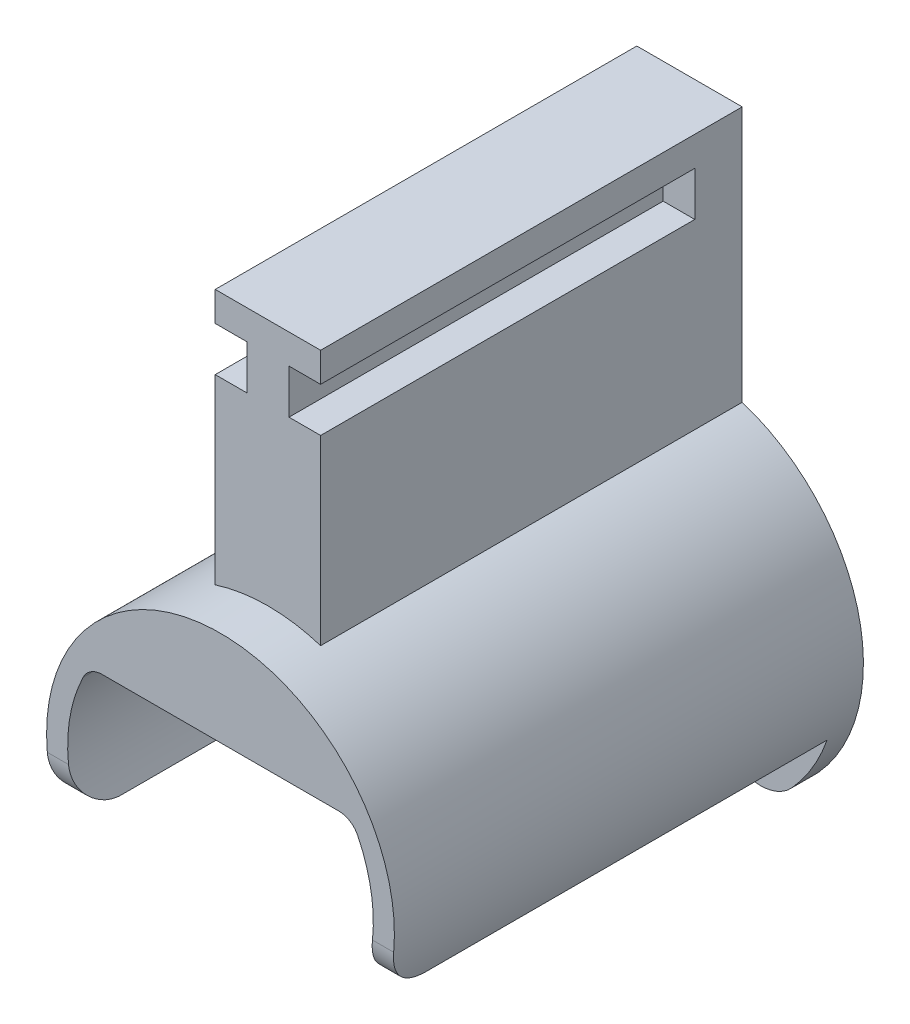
ISO-10303-21;
HEADER;
FILE_DESCRIPTION(('STEP AP214'),'2;1');
FILE_NAME('part.step','',(''),(''),'','','');
FILE_SCHEMA(('AUTOMOTIVE_DESIGN { 1 0 10303 214 1 1 1 1 }'));
ENDSEC;
DATA;
#1=APPLICATION_CONTEXT('core data for automotive mechanical design processes');
#2=APPLICATION_PROTOCOL_DEFINITION('international standard','automotive_design',2000,#1);
#3=PRODUCT_CONTEXT('',#1,'mechanical');
#4=PRODUCT('Part','Part','',(#3));
#5=PRODUCT_RELATED_PRODUCT_CATEGORY('part','',(#4));
#6=PRODUCT_DEFINITION_FORMATION('','',#4);
#7=PRODUCT_DEFINITION_CONTEXT('part definition',#1,'design');
#8=PRODUCT_DEFINITION('design','',#6,#7);
#9=PRODUCT_DEFINITION_SHAPE('','',#8);
#10=(LENGTH_UNIT() NAMED_UNIT(*) SI_UNIT(.MILLI.,.METRE.));
#11=(NAMED_UNIT(*) PLANE_ANGLE_UNIT() SI_UNIT($,.RADIAN.));
#12=(NAMED_UNIT(*) SI_UNIT($,.STERADIAN.) SOLID_ANGLE_UNIT());
#13=UNCERTAINTY_MEASURE_WITH_UNIT(LENGTH_MEASURE(1.E-05),#10,'distance_accuracy_value','');
#14=(GEOMETRIC_REPRESENTATION_CONTEXT(3) GLOBAL_UNCERTAINTY_ASSIGNED_CONTEXT((#13)) GLOBAL_UNIT_ASSIGNED_CONTEXT((#10,
#11,#12)) REPRESENTATION_CONTEXT('',''));
#15=CARTESIAN_POINT('',(0.,0.,0.));
#16=DIRECTION('',(0.,0.,1.));
#17=DIRECTION('',(1.,0.,0.));
#18=AXIS2_PLACEMENT_3D('',#15,#16,#17);
#19=CARTESIAN_POINT('',(5.,40.,70.7548125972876));
#20=DIRECTION('',(-1.,0.,0.));
#21=DIRECTION('',(0.,-1.,0.));
#22=AXIS2_PLACEMENT_3D('',#19,#20,#21);
#23=PLANE('',#22);
#24=DIRECTION('',(0.,1.,0.));
#25=VECTOR('',#24,1.);
#26=CARTESIAN_POINT('',(4.99999999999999,40.,40.));
#27=LINE('',#26,#25);
#28=CARTESIAN_POINT('',(5.,15.7241851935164,40.));
#29=VERTEX_POINT('',#28);
#30=CARTESIAN_POINT('',(5.,33.,40.));
#31=VERTEX_POINT('',#30);
#32=EDGE_CURVE('E616',#29,#31,#27,.T.);
#33=ORIENTED_EDGE('',*,*,#32,.F.);
#34=DIRECTION('',(0.,0.,-1.));
#35=VECTOR('',#34,1.);
#36=CARTESIAN_POINT('',(5.,15.7241851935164,70.7548125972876));
#37=LINE('',#36,#35);
#38=CARTESIAN_POINT('',(5.,15.7241851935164,0.));
#39=VERTEX_POINT('',#38);
#40=EDGE_CURVE('E245',#29,#39,#37,.T.);
#41=ORIENTED_EDGE('',*,*,#40,.T.);
#42=DIRECTION('',(0.,1.,0.));
#43=VECTOR('',#42,1.);
#44=CARTESIAN_POINT('',(5.,40.,0.));
#45=LINE('',#44,#43);
#46=CARTESIAN_POINT('',(5.,40.,0.));
#47=VERTEX_POINT('',#46);
#48=EDGE_CURVE('E254',#39,#47,#45,.T.);
#49=ORIENTED_EDGE('',*,*,#48,.T.);
#50=DIRECTION('',(0.,0.,-1.));
#51=VECTOR('',#50,1.);
#52=CARTESIAN_POINT('',(5.,40.,70.7548125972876));
#53=LINE('',#52,#51);
#54=CARTESIAN_POINT('',(4.99999999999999,40.,40.));
#55=VERTEX_POINT('',#54);
#56=EDGE_CURVE('E260',#55,#47,#53,.T.);
#57=ORIENTED_EDGE('',*,*,#56,.F.);
#58=CARTESIAN_POINT('',(4.99999999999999,37.2,40.));
#59=VERTEX_POINT('',#58);
#60=EDGE_CURVE('E246',#59,#55,#27,.T.);
#61=ORIENTED_EDGE('',*,*,#60,.F.);
#62=DIRECTION('',(0.,0.,-1.));
#63=VECTOR('',#62,1.);
#64=CARTESIAN_POINT('',(5.00000000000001,37.2,4.5));
#65=LINE('',#64,#63);
#66=CARTESIAN_POINT('',(5.,37.2,4.5));
#67=VERTEX_POINT('',#66);
#68=EDGE_CURVE('E591',#59,#67,#65,.T.);
#69=ORIENTED_EDGE('',*,*,#68,.T.);
#70=DIRECTION('',(0.,-1.,0.));
#71=VECTOR('',#70,1.);
#72=CARTESIAN_POINT('',(5.00000000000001,37.2,4.5));
#73=LINE('',#72,#71);
#74=CARTESIAN_POINT('',(5.00000000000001,33.,4.5));
#75=VERTEX_POINT('',#74);
#76=EDGE_CURVE('E593',#67,#75,#73,.T.);
#77=ORIENTED_EDGE('',*,*,#76,.T.);
#78=DIRECTION('',(0.,0.,1.));
#79=VECTOR('',#78,1.);
#80=CARTESIAN_POINT('',(5.00000000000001,33.,4.5));
#81=LINE('',#80,#79);
#82=EDGE_CURVE('E587',#75,#31,#81,.T.);
#83=ORIENTED_EDGE('',*,*,#82,.T.);
#84=EDGE_LOOP('',(#33,#41,#49,#57,#61,#69,#77,#83));
#85=FACE_BOUND('',#84,.T.);
#86=ADVANCED_FACE('F33',(#85),#23,.F.);
#87=CARTESIAN_POINT('',(-5.,40.,70.7548125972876));
#88=DIRECTION('',(1.,0.,0.));
#89=DIRECTION('',(0.,1.,0.));
#90=AXIS2_PLACEMENT_3D('',#87,#88,#89);
#91=PLANE('',#90);
#92=DIRECTION('',(0.,-1.,0.));
#93=VECTOR('',#92,1.);
#94=CARTESIAN_POINT('',(-5.,40.,40.));
#95=LINE('',#94,#93);
#96=CARTESIAN_POINT('',(-5.,40.,40.));
#97=VERTEX_POINT('',#96);
#98=CARTESIAN_POINT('',(-5.,37.2,40.));
#99=VERTEX_POINT('',#98);
#100=EDGE_CURVE('E236',#97,#99,#95,.T.);
#101=ORIENTED_EDGE('',*,*,#100,.F.);
#102=DIRECTION('',(0.,0.,-1.));
#103=VECTOR('',#102,1.);
#104=CARTESIAN_POINT('',(-5.,40.,70.7548125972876));
#105=LINE('',#104,#103);
#106=CARTESIAN_POINT('',(-5.,40.,0.));
#107=VERTEX_POINT('',#106);
#108=EDGE_CURVE('E256',#97,#107,#105,.T.);
#109=ORIENTED_EDGE('',*,*,#108,.T.);
#110=DIRECTION('',(0.,-1.,0.));
#111=VECTOR('',#110,1.);
#112=CARTESIAN_POINT('',(-5.,40.,0.));
#113=LINE('',#112,#111);
#114=CARTESIAN_POINT('',(-5.,15.7241851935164,0.));
#115=VERTEX_POINT('',#114);
#116=EDGE_CURVE('E251',#107,#115,#113,.T.);
#117=ORIENTED_EDGE('',*,*,#116,.T.);
#118=DIRECTION('',(0.,0.,-1.));
#119=VECTOR('',#118,1.);
#120=CARTESIAN_POINT('',(-5.,15.7241851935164,70.7548125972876));
#121=LINE('',#120,#119);
#122=CARTESIAN_POINT('',(-5.,15.7241851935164,40.));
#123=VERTEX_POINT('',#122);
#124=EDGE_CURVE('E242',#123,#115,#121,.T.);
#125=ORIENTED_EDGE('',*,*,#124,.F.);
#126=CARTESIAN_POINT('',(-5.,33.,40.));
#127=VERTEX_POINT('',#126);
#128=EDGE_CURVE('E225',#127,#123,#95,.T.);
#129=ORIENTED_EDGE('',*,*,#128,.F.);
#130=DIRECTION('',(0.,0.,1.));
#131=VECTOR('',#130,1.);
#132=CARTESIAN_POINT('',(-5.00000000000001,33.,4.5));
#133=LINE('',#132,#131);
#134=CARTESIAN_POINT('',(-5.,33.,4.5));
#135=VERTEX_POINT('',#134);
#136=EDGE_CURVE('E570',#135,#127,#133,.T.);
#137=ORIENTED_EDGE('',*,*,#136,.F.);
#138=DIRECTION('',(0.,-1.,0.));
#139=VECTOR('',#138,1.);
#140=CARTESIAN_POINT('',(-5.00000000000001,37.2,4.5));
#141=LINE('',#140,#139);
#142=CARTESIAN_POINT('',(-5.00000000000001,37.2,4.5));
#143=VERTEX_POINT('',#142);
#144=EDGE_CURVE('E572',#143,#135,#141,.T.);
#145=ORIENTED_EDGE('',*,*,#144,.F.);
#146=DIRECTION('',(0.,0.,-1.));
#147=VECTOR('',#146,1.);
#148=CARTESIAN_POINT('',(-5.00000000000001,37.2,4.5));
#149=LINE('',#148,#147);
#150=EDGE_CURVE('E567',#99,#143,#149,.T.);
#151=ORIENTED_EDGE('',*,*,#150,.F.);
#152=EDGE_LOOP('',(#101,#109,#117,#125,#129,#137,#145,#151));
#153=FACE_BOUND('',#152,.T.);
#154=ADVANCED_FACE('F249',(#153),#91,.F.);
#155=CARTESIAN_POINT('',(-5.,40.,70.7548125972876));
#156=DIRECTION('',(0.,-1.,0.));
#157=DIRECTION('',(0.,0.,-1.));
#158=AXIS2_PLACEMENT_3D('',#155,#156,#157);
#159=PLANE('',#158);
#160=DIRECTION('',(-1.,0.,0.));
#161=VECTOR('',#160,1.);
#162=CARTESIAN_POINT('',(-5.,40.,40.));
#163=LINE('',#162,#161);
#164=EDGE_CURVE('E614',#55,#97,#163,.T.);
#165=ORIENTED_EDGE('',*,*,#164,.F.);
#166=ORIENTED_EDGE('',*,*,#56,.T.);
#167=DIRECTION('',(-1.,0.,0.));
#168=VECTOR('',#167,1.);
#169=CARTESIAN_POINT('',(-5.,40.,0.));
#170=LINE('',#169,#168);
#171=EDGE_CURVE('E262',#47,#107,#170,.T.);
#172=ORIENTED_EDGE('',*,*,#171,.T.);
#173=ORIENTED_EDGE('',*,*,#108,.F.);
#174=EDGE_LOOP('',(#165,#166,#172,#173));
#175=FACE_BOUND('',#174,.T.);
#176=ADVANCED_FACE('F401',(#175),#159,.F.);
#177=CARTESIAN_POINT('',(-2.00000000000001,37.2,4.5));
#178=DIRECTION('',(0.,1.,0.));
#179=DIRECTION('',(-1.,0.,0.));
#180=AXIS2_PLACEMENT_3D('',#177,#178,#179);
#181=PLANE('',#180);
#182=DIRECTION('',(1.,0.,0.));
#183=VECTOR('',#182,1.);
#184=CARTESIAN_POINT('',(-2.00000000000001,37.2,40.));
#185=LINE('',#184,#183);
#186=CARTESIAN_POINT('',(-2.00000000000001,37.2,40.));
#187=VERTEX_POINT('',#186);
#188=EDGE_CURVE('E596',#99,#187,#185,.T.);
#189=ORIENTED_EDGE('',*,*,#188,.F.);
#190=ORIENTED_EDGE('',*,*,#150,.T.);
#191=DIRECTION('',(-1.,0.,0.));
#192=VECTOR('',#191,1.);
#193=CARTESIAN_POINT('',(-2.00000000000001,37.2,4.5));
#194=LINE('',#193,#192);
#195=CARTESIAN_POINT('',(-2.00000000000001,37.2,4.5));
#196=VERTEX_POINT('',#195);
#197=EDGE_CURVE('E264',#196,#143,#194,.T.);
#198=ORIENTED_EDGE('',*,*,#197,.F.);
#199=DIRECTION('',(0.,0.,-1.));
#200=VECTOR('',#199,1.);
#201=CARTESIAN_POINT('',(-2.00000000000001,37.2,4.5));
#202=LINE('',#201,#200);
#203=EDGE_CURVE('E564',#187,#196,#202,.T.);
#204=ORIENTED_EDGE('',*,*,#203,.F.);
#205=EDGE_LOOP('',(#189,#190,#198,#204));
#206=FACE_BOUND('',#205,.T.);
#207=ADVANCED_FACE('F656',(#206),#181,.F.);
#208=CARTESIAN_POINT('',(-2.00000000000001,33.,4.5));
#209=DIRECTION('',(0.,-1.,0.));
#210=DIRECTION('',(1.,0.,0.));
#211=AXIS2_PLACEMENT_3D('',#208,#209,#210);
#212=PLANE('',#211);
#213=DIRECTION('',(-1.,0.,0.));
#214=VECTOR('',#213,1.);
#215=CARTESIAN_POINT('',(-2.00000000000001,33.,40.));
#216=LINE('',#215,#214);
#217=CARTESIAN_POINT('',(-2.00000000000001,33.,40.));
#218=VERTEX_POINT('',#217);
#219=EDGE_CURVE('E231',#218,#127,#216,.T.);
#220=ORIENTED_EDGE('',*,*,#219,.F.);
#221=DIRECTION('',(0.,0.,1.));
#222=VECTOR('',#221,1.);
#223=CARTESIAN_POINT('',(-2.00000000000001,33.,4.5));
#224=LINE('',#223,#222);
#225=CARTESIAN_POINT('',(-2.00000000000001,33.,4.5));
#226=VERTEX_POINT('',#225);
#227=EDGE_CURVE('E576',#226,#218,#224,.T.);
#228=ORIENTED_EDGE('',*,*,#227,.F.);
#229=DIRECTION('',(-1.,0.,0.));
#230=VECTOR('',#229,1.);
#231=CARTESIAN_POINT('',(-2.00000000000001,33.,4.5));
#232=LINE('',#231,#230);
#233=EDGE_CURVE('E561',#226,#135,#232,.T.);
#234=ORIENTED_EDGE('',*,*,#233,.T.);
#235=ORIENTED_EDGE('',*,*,#136,.T.);
#236=EDGE_LOOP('',(#220,#228,#234,#235));
#237=FACE_BOUND('',#236,.T.);
#238=ADVANCED_FACE('F654',(#237),#212,.F.);
#239=CARTESIAN_POINT('',(-2.,0.,0.));
#240=DIRECTION('',(-1.,0.,0.));
#241=DIRECTION('',(0.,-1.,0.));
#242=AXIS2_PLACEMENT_3D('',#239,#240,#241);
#243=PLANE('',#242);
#244=ORIENTED_EDGE('',*,*,#227,.T.);
#245=DIRECTION('',(0.,1.,0.));
#246=VECTOR('',#245,1.);
#247=CARTESIAN_POINT('',(-2.,0.,40.));
#248=LINE('',#247,#246);
#249=EDGE_CURVE('E605',#218,#187,#248,.T.);
#250=ORIENTED_EDGE('',*,*,#249,.T.);
#251=ORIENTED_EDGE('',*,*,#203,.T.);
#252=DIRECTION('',(0.,-1.,0.));
#253=VECTOR('',#252,1.);
#254=CARTESIAN_POINT('',(-2.00000000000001,37.2,4.5));
#255=LINE('',#254,#253);
#256=EDGE_CURVE('E569',#196,#226,#255,.T.);
#257=ORIENTED_EDGE('',*,*,#256,.T.);
#258=EDGE_LOOP('',(#244,#250,#251,#257));
#259=FACE_BOUND('',#258,.T.);
#260=ADVANCED_FACE('F644',(#259),#243,.T.);
#261=CARTESIAN_POINT('',(2.00000000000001,33.,4.5));
#262=DIRECTION('',(0.,1.,0.));
#263=DIRECTION('',(-1.,0.,0.));
#264=AXIS2_PLACEMENT_3D('',#261,#262,#263);
#265=PLANE('',#264);
#266=DIRECTION('',(0.,0.,1.));
#267=VECTOR('',#266,1.);
#268=CARTESIAN_POINT('',(2.00000000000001,33.,4.5));
#269=LINE('',#268,#267);
#270=CARTESIAN_POINT('',(2.00000000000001,33.,4.5));
#271=VERTEX_POINT('',#270);
#272=CARTESIAN_POINT('',(2.00000000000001,33.,40.));
#273=VERTEX_POINT('',#272);
#274=EDGE_CURVE('E584',#271,#273,#269,.T.);
#275=ORIENTED_EDGE('',*,*,#274,.T.);
#276=DIRECTION('',(1.,0.,0.));
#277=VECTOR('',#276,1.);
#278=CARTESIAN_POINT('',(2.00000000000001,33.,40.));
#279=LINE('',#278,#277);
#280=EDGE_CURVE('E608',#273,#31,#279,.T.);
#281=ORIENTED_EDGE('',*,*,#280,.T.);
#282=ORIENTED_EDGE('',*,*,#82,.F.);
#283=DIRECTION('',(1.,0.,0.));
#284=VECTOR('',#283,1.);
#285=CARTESIAN_POINT('',(2.00000000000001,33.,4.5));
#286=LINE('',#285,#284);
#287=EDGE_CURVE('E574',#271,#75,#286,.T.);
#288=ORIENTED_EDGE('',*,*,#287,.F.);
#289=EDGE_LOOP('',(#275,#281,#282,#288));
#290=FACE_BOUND('',#289,.T.);
#291=ADVANCED_FACE('F641',(#290),#265,.T.);
#292=CARTESIAN_POINT('',(2.00000000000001,37.2,4.5));
#293=DIRECTION('',(0.,-1.,0.));
#294=DIRECTION('',(1.,0.,0.));
#295=AXIS2_PLACEMENT_3D('',#292,#293,#294);
#296=PLANE('',#295);
#297=ORIENTED_EDGE('',*,*,#68,.F.);
#298=DIRECTION('',(-1.,0.,0.));
#299=VECTOR('',#298,1.);
#300=CARTESIAN_POINT('',(2.00000000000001,37.2,40.));
#301=LINE('',#300,#299);
#302=CARTESIAN_POINT('',(2.00000000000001,37.2,40.));
#303=VERTEX_POINT('',#302);
#304=EDGE_CURVE('E611',#59,#303,#301,.T.);
#305=ORIENTED_EDGE('',*,*,#304,.T.);
#306=DIRECTION('',(0.,0.,-1.));
#307=VECTOR('',#306,1.);
#308=CARTESIAN_POINT('',(2.00000000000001,37.2,4.5));
#309=LINE('',#308,#307);
#310=CARTESIAN_POINT('',(2.00000000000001,37.2,4.5));
#311=VERTEX_POINT('',#310);
#312=EDGE_CURVE('E599',#303,#311,#309,.T.);
#313=ORIENTED_EDGE('',*,*,#312,.T.);
#314=DIRECTION('',(1.,0.,0.));
#315=VECTOR('',#314,1.);
#316=CARTESIAN_POINT('',(2.00000000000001,37.2,4.5));
#317=LINE('',#316,#315);
#318=EDGE_CURVE('E581',#311,#67,#317,.T.);
#319=ORIENTED_EDGE('',*,*,#318,.T.);
#320=EDGE_LOOP('',(#297,#305,#313,#319));
#321=FACE_BOUND('',#320,.T.);
#322=ADVANCED_FACE('F639',(#321),#296,.T.);
#323=CARTESIAN_POINT('',(2.,0.,0.));
#324=DIRECTION('',(1.,0.,0.));
#325=DIRECTION('',(0.,-1.,0.));
#326=AXIS2_PLACEMENT_3D('',#323,#324,#325);
#327=PLANE('',#326);
#328=ORIENTED_EDGE('',*,*,#312,.F.);
#329=DIRECTION('',(0.,-1.,0.));
#330=VECTOR('',#329,1.);
#331=CARTESIAN_POINT('',(2.,0.,40.));
#332=LINE('',#331,#330);
#333=EDGE_CURVE('E433',#303,#273,#332,.T.);
#334=ORIENTED_EDGE('',*,*,#333,.T.);
#335=ORIENTED_EDGE('',*,*,#274,.F.);
#336=DIRECTION('',(0.,-1.,0.));
#337=VECTOR('',#336,1.);
#338=CARTESIAN_POINT('',(2.00000000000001,37.2,4.5));
#339=LINE('',#338,#337);
#340=EDGE_CURVE('E590',#311,#271,#339,.T.);
#341=ORIENTED_EDGE('',*,*,#340,.F.);
#342=EDGE_LOOP('',(#328,#334,#335,#341));
#343=FACE_BOUND('',#342,.T.);
#344=ADVANCED_FACE('F383',(#343),#327,.T.);
#345=CARTESIAN_POINT('',(0.,0.,44.5));
#346=DIRECTION('',(0.,0.,1.));
#347=DIRECTION('',(1.,0.,0.));
#348=AXIS2_PLACEMENT_3D('',#345,#346,#347);
#349=PLANE('',#348);
#350=CARTESIAN_POINT('',(0.,0.,44.5));
#351=DIRECTION('',(0.,0.,1.));
#352=DIRECTION('',(1.,0.,0.));
#353=AXIS2_PLACEMENT_3D('',#350,#351,#352);
#354=CIRCLE('',#353,16.5);
#355=CARTESIAN_POINT('',(16.431676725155,-1.5,44.5));
#356=VERTEX_POINT('',#355);
#357=CARTESIAN_POINT('',(-16.431676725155,-1.5,44.5));
#358=VERTEX_POINT('',#357);
#359=EDGE_CURVE('E302',#356,#358,#354,.T.);
#360=ORIENTED_EDGE('',*,*,#359,.T.);
#361=DIRECTION('',(-1.,0.,0.));
#362=VECTOR('',#361,1.);
#363=CARTESIAN_POINT('',(-13.4164078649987,-1.5,44.5));
#364=LINE('',#363,#362);
#365=CARTESIAN_POINT('',(-14.422205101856,-1.5,44.5));
#366=VERTEX_POINT('',#365);
#367=EDGE_CURVE('E552',#358,#366,#364,.F.);
#368=ORIENTED_EDGE('',*,*,#367,.T.);
#369=CARTESIAN_POINT('',(0.,0.,44.5));
#370=DIRECTION('',(0.,0.,1.));
#371=DIRECTION('',(1.,0.,0.));
#372=AXIS2_PLACEMENT_3D('',#369,#370,#371);
#373=CIRCLE('',#372,14.5);
#374=CARTESIAN_POINT('',(-13.0209677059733,6.38,44.5));
#375=VERTEX_POINT('',#374);
#376=EDGE_CURVE('E300',#375,#366,#373,.T.);
#377=ORIENTED_EDGE('',*,*,#376,.F.);
#378=CARTESIAN_POINT('',(-11.2249721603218,5.5,44.5));
#379=DIRECTION('',(0.,0.,1.));
#380=DIRECTION('',(1.,0.,0.));
#381=AXIS2_PLACEMENT_3D('',#378,#379,#380);
#382=CIRCLE('',#381,2.);
#383=CARTESIAN_POINT('',(-11.2249721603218,7.5,44.5));
#384=VERTEX_POINT('',#383);
#385=EDGE_CURVE('E508',#375,#384,#382,.F.);
#386=ORIENTED_EDGE('',*,*,#385,.T.);
#387=DIRECTION('',(1.,0.,0.));
#388=VECTOR('',#387,1.);
#389=CARTESIAN_POINT('',(-14.6969384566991,7.5,44.5));
#390=LINE('',#389,#388);
#391=CARTESIAN_POINT('',(11.2249721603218,7.5,44.5));
#392=VERTEX_POINT('',#391);
#393=EDGE_CURVE('E293',#384,#392,#390,.T.);
#394=ORIENTED_EDGE('',*,*,#393,.T.);
#395=CARTESIAN_POINT('',(11.2249721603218,5.5,44.5));
#396=DIRECTION('',(0.,0.,1.));
#397=DIRECTION('',(1.,0.,0.));
#398=AXIS2_PLACEMENT_3D('',#395,#396,#397);
#399=CIRCLE('',#398,2.);
#400=CARTESIAN_POINT('',(13.0209677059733,6.38,44.5));
#401=VERTEX_POINT('',#400);
#402=EDGE_CURVE('E506',#392,#401,#399,.F.);
#403=ORIENTED_EDGE('',*,*,#402,.T.);
#404=CARTESIAN_POINT('',(14.422205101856,-1.5,44.5));
#405=VERTEX_POINT('',#404);
#406=EDGE_CURVE('E297',#405,#401,#373,.T.);
#407=ORIENTED_EDGE('',*,*,#406,.F.);
#408=DIRECTION('',(-1.,0.,0.));
#409=VECTOR('',#408,1.);
#410=CARTESIAN_POINT('',(15.556349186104,-1.5,44.5));
#411=LINE('',#410,#409);
#412=EDGE_CURVE('E553',#405,#356,#411,.F.);
#413=ORIENTED_EDGE('',*,*,#412,.T.);
#414=EDGE_LOOP('',(#360,#368,#377,#386,#394,#403,#407,#413));
#415=FACE_BOUND('',#414,.T.);
#416=ADVANCED_FACE('F346',(#415),#349,.T.);
#417=CARTESIAN_POINT('',(0.,0.,2.5));
#418=DIRECTION('',(0.,0.,-1.));
#419=DIRECTION('',(-1.,0.,0.));
#420=AXIS2_PLACEMENT_3D('',#417,#418,#419);
#421=CYLINDRICAL_SURFACE('',#420,16.5);
#422=ORIENTED_EDGE('',*,*,#40,.F.);
#423=CARTESIAN_POINT('',(0.,0.,40.));
#424=DIRECTION('',(0.,0.,-1.));
#425=DIRECTION('',(1.,0.,0.));
#426=AXIS2_PLACEMENT_3D('',#423,#424,#425);
#427=CIRCLE('',#426,16.5);
#428=EDGE_CURVE('E228',#123,#29,#427,.T.);
#429=ORIENTED_EDGE('',*,*,#428,.F.);
#430=ORIENTED_EDGE('',*,*,#124,.T.);
#431=CARTESIAN_POINT('',(0.,0.,0.));
#432=DIRECTION('',(0.,0.,1.));
#433=DIRECTION('',(1.,0.,0.));
#434=AXIS2_PLACEMENT_3D('',#431,#432,#433);
#435=CIRCLE('',#434,16.5);
#436=CARTESIAN_POINT('',(-12.21,-11.0980133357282,0.));
#437=VERTEX_POINT('',#436);
#438=EDGE_CURVE('E308',#115,#437,#435,.T.);
#439=ORIENTED_EDGE('',*,*,#438,.T.);
#440=DIRECTION('',(0.,0.,-1.));
#441=VECTOR('',#440,1.);
#442=CARTESIAN_POINT('',(-12.21,-11.0980133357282,2.5));
#443=LINE('',#442,#441);
#444=CARTESIAN_POINT('',(-12.21,-11.0980133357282,2.5));
#445=VERTEX_POINT('',#444);
#446=EDGE_CURVE('E323',#437,#445,#443,.F.);
#447=ORIENTED_EDGE('',*,*,#446,.T.);
#448=CARTESIAN_POINT('',(0.,0.,2.5));
#449=DIRECTION('',(0.,0.,1.));
#450=DIRECTION('',(1.,0.,0.));
#451=AXIS2_PLACEMENT_3D('',#448,#449,#450);
#452=CIRCLE('',#451,16.5);
#453=CARTESIAN_POINT('',(-15.556349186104,-5.5,2.5));
#454=VERTEX_POINT('',#453);
#455=EDGE_CURVE('E285',#445,#454,#452,.F.);
#456=ORIENTED_EDGE('',*,*,#455,.T.);
#457=DIRECTION('',(0.,0.,1.));
#458=VECTOR('',#457,1.);
#459=CARTESIAN_POINT('',(-15.556349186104,-5.5,-30.5));
#460=LINE('',#459,#458);
#461=CARTESIAN_POINT('',(-15.556349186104,-5.5,40.5));
#462=VERTEX_POINT('',#461);
#463=EDGE_CURVE('E286',#454,#462,#460,.T.);
#464=ORIENTED_EDGE('',*,*,#463,.T.);
#465=CARTESIAN_POINT('',(-15.556349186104,-5.5,40.5));
#466=CARTESIAN_POINT('',(-15.5563352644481,-5.5000142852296,40.6088143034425));
#467=CARTESIAN_POINT('',(-15.5579187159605,-5.49556008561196,40.7176196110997));
#468=CARTESIAN_POINT('',(-15.5641764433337,-5.4778255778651,40.9343934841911));
#469=CARTESIAN_POINT('',(-15.5688499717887,-5.46454740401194,41.0423622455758));
#470=CARTESIAN_POINT('',(-15.5811663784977,-5.42932617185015,41.256391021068));
#471=CARTESIAN_POINT('',(-15.5888007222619,-5.4074080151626,41.3624556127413));
#472=CARTESIAN_POINT('',(-15.6068353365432,-5.35513308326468,41.5722163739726));
#473=CARTESIAN_POINT('',(-15.6172356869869,-5.32477606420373,41.6759124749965));
#474=CARTESIAN_POINT('',(-15.6522157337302,-5.22144569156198,41.9822862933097));
#475=CARTESIAN_POINT('',(-15.6805920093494,-5.13616497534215,42.180537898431));
#476=CARTESIAN_POINT('',(-15.7448718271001,-4.93558872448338,42.5598230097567));
#477=CARTESIAN_POINT('',(-15.7807794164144,-4.82027704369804,42.7408471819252));
#478=CARTESIAN_POINT('',(-15.8584007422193,-4.55854463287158,43.0872665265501));
#479=CARTESIAN_POINT('',(-15.9002674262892,-4.41121981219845,43.2519452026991));
#480=CARTESIAN_POINT('',(-15.9854633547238,-4.09173100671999,43.5547347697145));
#481=CARTESIAN_POINT('',(-16.0287930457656,-3.91955938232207,43.6928374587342));
#482=CARTESIAN_POINT('',(-16.1152971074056,-3.54753622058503,43.9438128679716));
#483=CARTESIAN_POINT('',(-16.158401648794,-3.34687576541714,44.0555133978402));
#484=CARTESIAN_POINT('',(-16.2394089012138,-2.92862196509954,44.243192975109));
#485=CARTESIAN_POINT('',(-16.2773156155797,-2.71104185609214,44.3191996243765));
#486=CARTESIAN_POINT('',(-16.3358551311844,-2.32730967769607,44.4170283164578));
#487=CARTESIAN_POINT('',(-16.3583566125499,-2.16374665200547,44.4480515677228));
#488=CARTESIAN_POINT('',(-16.3885750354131,-1.91612529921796,44.4791664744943));
#489=CARTESIAN_POINT('',(-16.3980591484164,-1.83320241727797,44.4869681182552));
#490=CARTESIAN_POINT('',(-16.4158012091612,-1.66687878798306,44.4973865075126));
#491=CARTESIAN_POINT('',(-16.4240588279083,-1.58347791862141,44.5000018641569));
#492=CARTESIAN_POINT('',(-16.431676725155,-1.5,44.5));
#493=B_SPLINE_CURVE_WITH_KNOTS('',3,(#465,#466,#467,#468,#469,#470,#471,#472,#473,#474,#475,
#476,#477,#478,#479,#480,#481,#482,#483,#484,#485,#486,#487,#488,#489,#490,#491,#492),
.UNSPECIFIED.,.F.,.F.,(4,2,2,2,2,2,2,2,2,2,2,2,2,4),(0.,0.326324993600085,0.652571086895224,
0.977883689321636,1.30320569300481,1.95298212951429,2.60310864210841,3.27477422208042,
3.94664675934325,4.64431393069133,5.34144070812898,5.84406101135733,6.09538887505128,
6.34678403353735),.UNSPECIFIED.);
#494=EDGE_CURVE('E333',#462,#358,#493,.T.);
#495=ORIENTED_EDGE('',*,*,#494,.T.);
#496=ORIENTED_EDGE('',*,*,#359,.F.);
#497=CARTESIAN_POINT('',(16.431676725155,-1.5,44.5));
#498=CARTESIAN_POINT('',(16.4214065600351,-1.61262660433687,44.5000122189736));
#499=CARTESIAN_POINT('',(16.4099576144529,-1.72513356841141,44.4952435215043));
#500=CARTESIAN_POINT('',(16.3848614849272,-1.94907931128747,44.4762956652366));
#501=CARTESIAN_POINT('',(16.3712148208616,-2.06051833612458,44.4621187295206));
#502=CARTESIAN_POINT('',(16.341909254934,-2.28131459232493,44.4245462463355));
#503=CARTESIAN_POINT('',(16.3262547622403,-2.39067579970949,44.4011706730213));
#504=CARTESIAN_POINT('',(16.2931475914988,-2.606782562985,44.3454518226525));
#505=CARTESIAN_POINT('',(16.2756948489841,-2.71352802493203,44.3131082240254));
#506=CARTESIAN_POINT('',(16.2210478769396,-3.02867181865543,44.2030473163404));
#507=CARTESIAN_POINT('',(16.1815255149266,-3.23226820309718,44.1122497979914));
#508=CARTESIAN_POINT('',(16.098996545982,-3.62104454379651,43.8985975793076));
#509=CARTESIAN_POINT('',(16.0559884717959,-3.80621667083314,43.775729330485));
#510=CARTESIAN_POINT('',(15.9685433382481,-4.15803987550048,43.4977216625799));
#511=CARTESIAN_POINT('',(15.9240974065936,-4.32411326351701,43.3418532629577));
#512=CARTESIAN_POINT('',(15.8384810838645,-4.62790370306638,43.0035647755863));
#513=CARTESIAN_POINT('',(15.7973112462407,-4.7656159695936,42.8211402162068));
#514=CARTESIAN_POINT('',(15.7407801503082,-4.94792024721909,42.5310127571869));
#515=CARTESIAN_POINT('',(15.7227726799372,-5.00474403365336,42.4313135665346));
#516=CARTESIAN_POINT('',(15.6889642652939,-5.1097397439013,42.2271178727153));
#517=CARTESIAN_POINT('',(15.6731624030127,-5.15791526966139,42.1226233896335));
#518=CARTESIAN_POINT('',(15.6441849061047,-5.24514954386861,41.9096416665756));
#519=CARTESIAN_POINT('',(15.6310072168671,-5.28421542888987,41.8011576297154));
#520=CARTESIAN_POINT('',(15.6076210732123,-5.35289426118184,41.5809749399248));
#521=CARTESIAN_POINT('',(15.5974116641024,-5.38251024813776,41.4692773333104));
#522=CARTESIAN_POINT('',(15.5781656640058,-5.43799933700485,41.216072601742));
#523=CARTESIAN_POINT('',(15.5700127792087,-5.46122637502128,41.0739008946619));
#524=CARTESIAN_POINT('',(15.5618307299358,-5.48447637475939,40.8593517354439));
#525=CARTESIAN_POINT('',(15.5597779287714,-5.49029461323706,40.7876256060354));
#526=CARTESIAN_POINT('',(15.5570365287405,-5.49805640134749,40.6439390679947));
#527=CARTESIAN_POINT('',(15.5563479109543,-5.5000000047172,40.5719786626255));
#528=CARTESIAN_POINT('',(15.556349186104,-5.5,40.5));
#529=B_SPLINE_CURVE_WITH_KNOTS('',3,(#497,#498,#499,#500,#501,#502,#503,#504,#505,#506,#507,
#508,#509,#510,#511,#512,#513,#514,#515,#516,#517,#518,#519,#520,#521,#522,#523,#524,#525,#526,
#527,#528),.UNSPECIFIED.,.F.,.F.,(4,2,2,2,2,2,2,2,2,2,2,2,2,2,2,4),(0.,0.339155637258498,
0.678231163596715,1.01657443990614,1.35492984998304,2.0307591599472,2.70687444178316,
3.39986657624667,4.09297553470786,4.44109076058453,4.7890606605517,5.13675703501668,
5.48434145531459,5.91615382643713,6.13202706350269,6.34789730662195),.UNSPECIFIED.);
#530=CARTESIAN_POINT('',(15.556349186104,-5.5,40.5));
#531=VERTEX_POINT('',#530);
#532=EDGE_CURVE('E326',#356,#531,#529,.T.);
#533=ORIENTED_EDGE('',*,*,#532,.T.);
#534=DIRECTION('',(0.,0.,1.));
#535=VECTOR('',#534,1.);
#536=CARTESIAN_POINT('',(15.556349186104,-5.5,-30.5));
#537=LINE('',#536,#535);
#538=CARTESIAN_POINT('',(15.556349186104,-5.5,2.5));
#539=VERTEX_POINT('',#538);
#540=EDGE_CURVE('E280',#539,#531,#537,.T.);
#541=ORIENTED_EDGE('',*,*,#540,.F.);
#542=CARTESIAN_POINT('',(12.21,-11.0980133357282,2.5));
#543=VERTEX_POINT('',#542);
#544=EDGE_CURVE('E281',#539,#543,#452,.F.);
#545=ORIENTED_EDGE('',*,*,#544,.T.);
#546=DIRECTION('',(0.,0.,-1.));
#547=VECTOR('',#546,1.);
#548=CARTESIAN_POINT('',(12.21,-11.0980133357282,2.5));
#549=LINE('',#548,#547);
#550=CARTESIAN_POINT('',(12.21,-11.0980133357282,0.));
#551=VERTEX_POINT('',#550);
#552=EDGE_CURVE('E321',#543,#551,#549,.T.);
#553=ORIENTED_EDGE('',*,*,#552,.T.);
#554=EDGE_CURVE('E311',#551,#39,#435,.T.);
#555=ORIENTED_EDGE('',*,*,#554,.T.);
#556=EDGE_LOOP('',(#422,#429,#430,#439,#447,#456,#464,#495,#496,#533,#541,#545,#553,#555));
#557=FACE_BOUND('',#556,.T.);
#558=ADVANCED_FACE('F241',(#557),#421,.T.);
#559=CARTESIAN_POINT('',(0.,0.,2.5));
#560=DIRECTION('',(0.,0.,1.));
#561=DIRECTION('',(1.,0.,0.));
#562=AXIS2_PLACEMENT_3D('',#559,#560,#561);
#563=PLANE('',#562);
#564=CARTESIAN_POINT('',(-8.,0.,2.5));
#565=DIRECTION('',(0.,0.,1.));
#566=DIRECTION('',(1.,0.,0.));
#567=AXIS2_PLACEMENT_3D('',#564,#565,#566);
#568=CIRCLE('',#567,1.5);
#569=CARTESIAN_POINT('',(-6.5,0.,2.5));
#570=VERTEX_POINT('',#569);
#571=EDGE_CURVE('E620',#570,#570,#568,.F.);
#572=ORIENTED_EDGE('',*,*,#571,.T.);
#573=EDGE_LOOP('',(#572));
#574=FACE_BOUND('',#573,.T.);
#575=CARTESIAN_POINT('',(8.,0.,2.5));
#576=DIRECTION('',(0.,0.,1.));
#577=DIRECTION('',(1.,0.,0.));
#578=AXIS2_PLACEMENT_3D('',#575,#576,#577);
#579=CIRCLE('',#578,1.5);
#580=CARTESIAN_POINT('',(9.5,0.,2.5));
#581=VERTEX_POINT('',#580);
#582=EDGE_CURVE('E237',#581,#581,#579,.F.);
#583=ORIENTED_EDGE('',*,*,#582,.T.);
#584=EDGE_LOOP('',(#583));
#585=FACE_BOUND('',#584,.T.);
#586=DIRECTION('',(1.,0.,0.));
#587=VECTOR('',#586,1.);
#588=CARTESIAN_POINT('',(-15.556349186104,-5.5,2.5));
#589=LINE('',#588,#587);
#590=CARTESIAN_POINT('',(12.328828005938,-5.5,2.5));
#591=VERTEX_POINT('',#590);
#592=EDGE_CURVE('E284',#591,#539,#589,.T.);
#593=ORIENTED_EDGE('',*,*,#592,.F.);
#594=CARTESIAN_POINT('',(0.,0.,2.5));
#595=DIRECTION('',(0.,0.,1.));
#596=DIRECTION('',(1.,0.,0.));
#597=AXIS2_PLACEMENT_3D('',#594,#595,#596);
#598=CIRCLE('',#597,13.5);
#599=CARTESIAN_POINT('',(-12.328828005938,-5.5,2.5));
#600=VERTEX_POINT('',#599);
#601=EDGE_CURVE('E512',#591,#600,#598,.T.);
#602=ORIENTED_EDGE('',*,*,#601,.T.);
#603=EDGE_CURVE('E291',#454,#600,#589,.T.);
#604=ORIENTED_EDGE('',*,*,#603,.F.);
#605=ORIENTED_EDGE('',*,*,#455,.F.);
#606=CARTESIAN_POINT('',(-9.25,-8.40758586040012,2.5));
#607=DIRECTION('',(0.,0.,1.));
#608=DIRECTION('',(1.,0.,0.));
#609=AXIS2_PLACEMENT_3D('',#606,#607,#608);
#610=CIRCLE('',#609,4.);
#611=CARTESIAN_POINT('',(-5.25,-8.40758586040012,2.5));
#612=VERTEX_POINT('',#611);
#613=EDGE_CURVE('E535',#445,#612,#610,.T.);
#614=ORIENTED_EDGE('',*,*,#613,.T.);
#615=DIRECTION('',(0.,-1.,0.));
#616=VECTOR('',#615,1.);
#617=CARTESIAN_POINT('',(-5.25,0.,2.5));
#618=LINE('',#617,#616);
#619=CARTESIAN_POINT('',(-5.25,0.,2.5));
#620=VERTEX_POINT('',#619);
#621=EDGE_CURVE('E268',#620,#612,#618,.T.);
#622=ORIENTED_EDGE('',*,*,#621,.F.);
#623=CARTESIAN_POINT('',(0.,0.,2.5));
#624=DIRECTION('',(0.,0.,1.));
#625=DIRECTION('',(1.,0.,0.));
#626=AXIS2_PLACEMENT_3D('',#623,#624,#625);
#627=CIRCLE('',#626,5.25);
#628=CARTESIAN_POINT('',(5.25,0.,2.5));
#629=VERTEX_POINT('',#628);
#630=EDGE_CURVE('E305',#629,#620,#627,.T.);
#631=ORIENTED_EDGE('',*,*,#630,.F.);
#632=DIRECTION('',(0.,1.,0.));
#633=VECTOR('',#632,1.);
#634=CARTESIAN_POINT('',(5.25,0.,2.5));
#635=LINE('',#634,#633);
#636=CARTESIAN_POINT('',(5.25,-8.40758586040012,2.5));
#637=VERTEX_POINT('',#636);
#638=EDGE_CURVE('E271',#637,#629,#635,.T.);
#639=ORIENTED_EDGE('',*,*,#638,.F.);
#640=CARTESIAN_POINT('',(9.25,-8.40758586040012,2.5));
#641=DIRECTION('',(0.,0.,1.));
#642=DIRECTION('',(1.,0.,0.));
#643=AXIS2_PLACEMENT_3D('',#640,#641,#642);
#644=CIRCLE('',#643,4.);
#645=EDGE_CURVE('E537',#637,#543,#644,.T.);
#646=ORIENTED_EDGE('',*,*,#645,.T.);
#647=ORIENTED_EDGE('',*,*,#544,.F.);
#648=EDGE_LOOP('',(#593,#602,#604,#605,#614,#622,#631,#639,#646,#647));
#649=FACE_BOUND('',#648,.T.);
#650=ADVANCED_FACE('F345',(#574,#585,#649),#563,.T.);
#651=CARTESIAN_POINT('',(0.,0.,0.));
#652=DIRECTION('',(0.,0.,1.));
#653=DIRECTION('',(1.,0.,0.));
#654=AXIS2_PLACEMENT_3D('',#651,#652,#653);
#655=PLANE('',#654);
#656=CARTESIAN_POINT('',(-8.,0.,0.));
#657=DIRECTION('',(0.,0.,1.));
#658=DIRECTION('',(1.,0.,0.));
#659=AXIS2_PLACEMENT_3D('',#656,#657,#658);
#660=CIRCLE('',#659,2.50000000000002);
#661=CARTESIAN_POINT('',(-5.49999999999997,0.,0.));
#662=VERTEX_POINT('',#661);
#663=EDGE_CURVE('E41',#662,#662,#660,.T.);
#664=ORIENTED_EDGE('',*,*,#663,.T.);
#665=EDGE_LOOP('',(#664));
#666=FACE_BOUND('',#665,.T.);
#667=CARTESIAN_POINT('',(8.,0.,0.));
#668=DIRECTION('',(0.,0.,1.));
#669=DIRECTION('',(1.,0.,0.));
#670=AXIS2_PLACEMENT_3D('',#667,#668,#669);
#671=CIRCLE('',#670,2.50000000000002);
#672=CARTESIAN_POINT('',(10.5,0.,0.));
#673=VERTEX_POINT('',#672);
#674=EDGE_CURVE('E756',#673,#673,#671,.T.);
#675=ORIENTED_EDGE('',*,*,#674,.T.);
#676=EDGE_LOOP('',(#675));
#677=FACE_BOUND('',#676,.T.);
#678=DIRECTION('',(0.,1.,0.));
#679=VECTOR('',#678,1.);
#680=CARTESIAN_POINT('',(-5.25,0.,0.));
#681=LINE('',#680,#679);
#682=CARTESIAN_POINT('',(-5.25,-8.40758586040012,0.));
#683=VERTEX_POINT('',#682);
#684=CARTESIAN_POINT('',(-5.25,0.,0.));
#685=VERTEX_POINT('',#684);
#686=EDGE_CURVE('E277',#683,#685,#681,.T.);
#687=ORIENTED_EDGE('',*,*,#686,.F.);
#688=CARTESIAN_POINT('',(-9.25,-8.40758586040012,0.));
#689=DIRECTION('',(0.,0.,1.));
#690=DIRECTION('',(1.,0.,0.));
#691=AXIS2_PLACEMENT_3D('',#688,#689,#690);
#692=CIRCLE('',#691,4.);
#693=EDGE_CURVE('E486',#683,#437,#692,.F.);
#694=ORIENTED_EDGE('',*,*,#693,.T.);
#695=ORIENTED_EDGE('',*,*,#438,.F.);
#696=ORIENTED_EDGE('',*,*,#116,.F.);
#697=ORIENTED_EDGE('',*,*,#171,.F.);
#698=ORIENTED_EDGE('',*,*,#48,.F.);
#699=ORIENTED_EDGE('',*,*,#554,.F.);
#700=CARTESIAN_POINT('',(9.25,-8.40758586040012,0.));
#701=DIRECTION('',(0.,0.,1.));
#702=DIRECTION('',(1.,0.,0.));
#703=AXIS2_PLACEMENT_3D('',#700,#701,#702);
#704=CIRCLE('',#703,4.);
#705=CARTESIAN_POINT('',(5.25,-8.40758586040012,0.));
#706=VERTEX_POINT('',#705);
#707=EDGE_CURVE('E491',#551,#706,#704,.F.);
#708=ORIENTED_EDGE('',*,*,#707,.T.);
#709=DIRECTION('',(0.,-1.,0.));
#710=VECTOR('',#709,1.);
#711=CARTESIAN_POINT('',(5.25,0.,0.));
#712=LINE('',#711,#710);
#713=CARTESIAN_POINT('',(5.25,0.,0.));
#714=VERTEX_POINT('',#713);
#715=EDGE_CURVE('E265',#714,#706,#712,.T.);
#716=ORIENTED_EDGE('',*,*,#715,.F.);
#717=CARTESIAN_POINT('',(0.,0.,0.));
#718=DIRECTION('',(0.,0.,1.));
#719=DIRECTION('',(1.,0.,0.));
#720=AXIS2_PLACEMENT_3D('',#717,#718,#719);
#721=CIRCLE('',#720,5.25);
#722=EDGE_CURVE('E304',#714,#685,#721,.T.);
#723=ORIENTED_EDGE('',*,*,#722,.T.);
#724=EDGE_LOOP('',(#687,#694,#695,#696,#697,#698,#699,#708,#716,#723));
#725=FACE_BOUND('',#724,.T.);
#726=ADVANCED_FACE('F347',(#666,#677,#725),#655,.F.);
#727=CARTESIAN_POINT('',(0.,0.,2.5));
#728=DIRECTION('',(0.,0.,-1.));
#729=DIRECTION('',(-1.,0.,0.));
#730=AXIS2_PLACEMENT_3D('',#727,#728,#729);
#731=CYLINDRICAL_SURFACE('',#730,5.25);
#732=DIRECTION('',(0.,0.,1.));
#733=VECTOR('',#732,1.);
#734=CARTESIAN_POINT('',(5.25,0.,-0.00100000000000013));
#735=LINE('',#734,#733);
#736=EDGE_CURVE('E274',#714,#629,#735,.T.);
#737=ORIENTED_EDGE('',*,*,#736,.T.);
#738=ORIENTED_EDGE('',*,*,#630,.T.);
#739=DIRECTION('',(0.,0.,1.));
#740=VECTOR('',#739,1.);
#741=CARTESIAN_POINT('',(-5.25,0.,-0.00100000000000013));
#742=LINE('',#741,#740);
#743=EDGE_CURVE('E273',#685,#620,#742,.T.);
#744=ORIENTED_EDGE('',*,*,#743,.F.);
#745=ORIENTED_EDGE('',*,*,#722,.F.);
#746=EDGE_LOOP('',(#737,#738,#744,#745));
#747=FACE_BOUND('',#746,.T.);
#748=ADVANCED_FACE('F378',(#747),#731,.F.);
#749=CARTESIAN_POINT('',(0.,0.,44.5));
#750=DIRECTION('',(0.,0.,-1.));
#751=DIRECTION('',(-1.,0.,0.));
#752=AXIS2_PLACEMENT_3D('',#749,#750,#751);
#753=CYLINDRICAL_SURFACE('',#752,14.5);
#754=CARTESIAN_POINT('',(0.,0.,41.));
#755=DIRECTION('',(0.,0.,1.));
#756=DIRECTION('',(1.,0.,0.));
#757=AXIS2_PLACEMENT_3D('',#754,#755,#756);
#758=CIRCLE('',#757,14.5);
#759=CARTESIAN_POINT('',(13.0209677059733,6.38,41.));
#760=VERTEX_POINT('',#759);
#761=CARTESIAN_POINT('',(-13.0209677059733,6.38,41.));
#762=VERTEX_POINT('',#761);
#763=EDGE_CURVE('E684',#760,#762,#758,.T.);
#764=ORIENTED_EDGE('',*,*,#763,.T.);
#765=DIRECTION('',(0.,0.,-1.));
#766=VECTOR('',#765,1.);
#767=CARTESIAN_POINT('',(-13.0209677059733,6.38,44.5));
#768=LINE('',#767,#766);
#769=EDGE_CURVE('E48',#762,#375,#768,.F.);
#770=ORIENTED_EDGE('',*,*,#769,.T.);
#771=ORIENTED_EDGE('',*,*,#376,.T.);
#772=CARTESIAN_POINT('',(-14.422205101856,-1.5,44.5));
#773=CARTESIAN_POINT('',(-14.4105030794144,-1.61263497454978,44.5000126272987));
#774=CARTESIAN_POINT('',(-14.3974581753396,-1.72511619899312,44.4952428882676));
#775=CARTESIAN_POINT('',(-14.3688652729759,-1.94893270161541,44.4763101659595));
#776=CARTESIAN_POINT('',(-14.3533180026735,-2.06026830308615,44.4621499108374));
#777=CARTESIAN_POINT('',(-14.3199389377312,-2.28073807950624,44.4246556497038));
#778=CARTESIAN_POINT('',(-14.3021131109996,-2.38987717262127,44.4013452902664));
#779=CARTESIAN_POINT('',(-14.2644133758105,-2.60547711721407,44.3458194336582));
#780=CARTESIAN_POINT('',(-14.2445393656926,-2.71193783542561,44.3136034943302));
#781=CARTESIAN_POINT('',(-14.1823161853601,-3.02609810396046,44.2040642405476));
#782=CARTESIAN_POINT('',(-14.1373123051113,-3.228922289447,44.1137896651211));
#783=CARTESIAN_POINT('',(-14.0432549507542,-3.61619489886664,43.9015559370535));
#784=CARTESIAN_POINT('',(-13.9941991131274,-3.80063245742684,43.779578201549));
#785=CARTESIAN_POINT('',(-13.8939182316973,-4.15253954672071,43.5026298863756));
#786=CARTESIAN_POINT('',(-13.8426745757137,-4.31926077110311,43.3467141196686));
#787=CARTESIAN_POINT('',(-13.7437625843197,-4.62436739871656,43.0080299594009));
#788=CARTESIAN_POINT('',(-13.6960949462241,-4.76274728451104,42.8252563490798));
#789=CARTESIAN_POINT('',(-13.630466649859,-4.94617434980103,42.5340118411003));
#790=CARTESIAN_POINT('',(-13.6095092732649,-5.00344352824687,42.4337185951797));
#791=CARTESIAN_POINT('',(-13.5701380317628,-5.10925998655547,42.2281728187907));
#792=CARTESIAN_POINT('',(-13.5517230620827,-5.15781105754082,42.1229224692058));
#793=CARTESIAN_POINT('',(-13.5179508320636,-5.24568620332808,41.9082865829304));
#794=CARTESIAN_POINT('',(-13.502590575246,-5.28501932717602,41.7989052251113));
#795=CARTESIAN_POINT('',(-13.4753487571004,-5.35409667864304,41.576785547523));
#796=CARTESIAN_POINT('',(-13.463465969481,-5.38384428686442,41.4640484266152));
#797=CARTESIAN_POINT('',(-13.4413331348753,-5.43890158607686,41.2108547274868));
#798=CARTESIAN_POINT('',(-13.4320222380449,-5.46178283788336,41.0697717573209));
#799=CARTESIAN_POINT('',(-13.4226739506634,-5.48469521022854,40.8568120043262));
#800=CARTESIAN_POINT('',(-13.4203275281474,-5.49043108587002,40.7855969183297));
#801=CARTESIAN_POINT('',(-13.4171936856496,-5.49808360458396,40.6429273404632));
#802=CARTESIAN_POINT('',(-13.4164062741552,-5.5000002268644,40.5714728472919));
#803=CARTESIAN_POINT('',(-13.4164078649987,-5.5,40.5));
#804=B_SPLINE_CURVE_WITH_KNOTS('',3,(#772,#773,#774,#775,#776,#777,#778,#779,#780,#781,#782,
#783,#784,#785,#786,#787,#788,#789,#790,#791,#792,#793,#794,#795,#796,#797,#798,#799,#800,#801,
#802,#803),.UNSPECIFIED.,.F.,.F.,(4,2,2,2,2,2,2,2,2,2,2,2,2,2,2,4),(0.,0.33959288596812,
0.679087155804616,1.01770978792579,1.35634923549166,2.03257429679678,2.70919662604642,
3.40785667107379,4.1066526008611,4.45841152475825,4.8100171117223,5.16127607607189,
5.51241102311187,5.94104204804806,6.15539306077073,6.36974524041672),.UNSPECIFIED.);
#805=CARTESIAN_POINT('',(-13.4164078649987,-5.5,40.5));
#806=VERTEX_POINT('',#805);
#807=EDGE_CURVE('E357',#366,#806,#804,.T.);
#808=ORIENTED_EDGE('',*,*,#807,.T.);
#809=DIRECTION('',(0.,0.,-1.));
#810=VECTOR('',#809,1.);
#811=CARTESIAN_POINT('',(-13.4164078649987,-5.5,44.5));
#812=LINE('',#811,#810);
#813=CARTESIAN_POINT('',(-13.4164078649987,-5.5,3.50000000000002));
#814=VERTEX_POINT('',#813);
#815=EDGE_CURVE('E313',#814,#806,#812,.F.);
#816=ORIENTED_EDGE('',*,*,#815,.F.);
#817=CARTESIAN_POINT('',(0.,0.,3.5));
#818=DIRECTION('',(0.,0.,1.));
#819=DIRECTION('',(1.,0.,0.));
#820=AXIS2_PLACEMENT_3D('',#817,#818,#819);
#821=CIRCLE('',#820,14.5);
#822=CARTESIAN_POINT('',(13.4164078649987,-5.5,3.50000000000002));
#823=VERTEX_POINT('',#822);
#824=EDGE_CURVE('E510',#814,#823,#821,.F.);
#825=ORIENTED_EDGE('',*,*,#824,.T.);
#826=DIRECTION('',(0.,0.,-1.));
#827=VECTOR('',#826,1.);
#828=CARTESIAN_POINT('',(13.4164078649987,-5.5,44.5));
#829=LINE('',#828,#827);
#830=CARTESIAN_POINT('',(13.4164078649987,-5.5,40.5));
#831=VERTEX_POINT('',#830);
#832=EDGE_CURVE('E315',#831,#823,#829,.T.);
#833=ORIENTED_EDGE('',*,*,#832,.F.);
#834=CARTESIAN_POINT('',(13.4164078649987,-5.5,40.5));
#835=CARTESIAN_POINT('',(13.4163913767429,-5.50001529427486,40.607699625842));
#836=CARTESIAN_POINT('',(13.4181906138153,-5.49565066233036,40.715388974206));
#837=CARTESIAN_POINT('',(13.4252971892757,-5.47828038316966,40.9299200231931));
#838=CARTESIAN_POINT('',(13.4306034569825,-5.46527737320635,41.0367619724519));
#839=CARTESIAN_POINT('',(13.4445765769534,-5.43080900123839,41.2484695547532));
#840=CARTESIAN_POINT('',(13.4532316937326,-5.40937318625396,41.3533407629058));
#841=CARTESIAN_POINT('',(13.4736646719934,-5.35827521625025,41.560722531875));
#842=CARTESIAN_POINT('',(13.4854426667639,-5.32861271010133,41.6632329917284));
#843=CARTESIAN_POINT('',(13.5250212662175,-5.22772180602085,41.966023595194));
#844=CARTESIAN_POINT('',(13.5570909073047,-5.14453247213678,42.1619113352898));
#845=CARTESIAN_POINT('',(13.6296570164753,-4.94906635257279,42.5368527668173));
#846=CARTESIAN_POINT('',(13.6701596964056,-4.83676811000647,42.7158939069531));
#847=CARTESIAN_POINT('',(13.7581116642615,-4.58076657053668,43.0606454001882));
#848=CARTESIAN_POINT('',(13.8057849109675,-4.43591959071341,43.2254502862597));
#849=CARTESIAN_POINT('',(13.9028629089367,-4.12158214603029,43.5290413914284));
#850=CARTESIAN_POINT('',(13.9522682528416,-3.95208318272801,43.6678185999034));
#851=CARTESIAN_POINT('',(14.0516611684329,-3.58316878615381,43.9224478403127));
#852=CARTESIAN_POINT('',(14.1015503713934,-3.38266973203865,44.0367733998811));
#853=CARTESIAN_POINT('',(14.1954492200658,-2.96396830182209,44.2295884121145));
#854=CARTESIAN_POINT('',(14.2394637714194,-2.74578094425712,44.3081078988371));
#855=CARTESIAN_POINT('',(14.3083050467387,-2.35601685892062,44.4110929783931));
#856=CARTESIAN_POINT('',(14.3351449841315,-2.18707513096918,44.4443055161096));
#857=CARTESIAN_POINT('',(14.3711087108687,-1.93098091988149,44.4776473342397));
#858=CARTESIAN_POINT('',(14.3823829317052,-1.84514687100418,44.4860151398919));
#859=CARTESIAN_POINT('',(14.4034343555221,-1.67290985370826,44.4971933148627));
#860=CARTESIAN_POINT('',(14.4132111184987,-1.58650672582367,44.5000020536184));
#861=CARTESIAN_POINT('',(14.422205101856,-1.5,44.5));
#862=B_SPLINE_CURVE_WITH_KNOTS('',3,(#834,#835,#836,#837,#838,#839,#840,#841,#842,#843,#844,
#845,#846,#847,#848,#849,#850,#851,#852,#853,#854,#855,#856,#857,#858,#859,#860,#861),
.UNSPECIFIED.,.F.,.F.,(4,2,2,2,2,2,2,2,2,2,2,2,2,4),(0.,0.322978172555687,0.645857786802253,
0.967616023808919,1.28938799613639,1.93188349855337,2.57485395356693,3.2454989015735,
3.91637559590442,4.62140055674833,5.32583305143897,5.84706781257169,6.10781908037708,
6.36864681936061),.UNSPECIFIED.);
#863=EDGE_CURVE('E366',#831,#405,#862,.T.);
#864=ORIENTED_EDGE('',*,*,#863,.T.);
#865=ORIENTED_EDGE('',*,*,#406,.T.);
#866=DIRECTION('',(0.,0.,-1.));
#867=VECTOR('',#866,1.);
#868=CARTESIAN_POINT('',(13.0209677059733,6.38,44.5));
#869=LINE('',#868,#867);
#870=EDGE_CURVE('E56',#401,#760,#869,.T.);
#871=ORIENTED_EDGE('',*,*,#870,.T.);
#872=EDGE_LOOP('',(#764,#770,#771,#808,#816,#825,#833,#864,#865,#871));
#873=FACE_BOUND('',#872,.T.);
#874=ADVANCED_FACE('F372',(#873),#753,.F.);
#875=CARTESIAN_POINT('',(-14.6969384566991,7.5,42.));
#876=DIRECTION('',(0.,-1.,0.));
#877=DIRECTION('',(0.,0.,-1.));
#878=AXIS2_PLACEMENT_3D('',#875,#876,#877);
#879=PLANE('',#878);
#880=DIRECTION('',(1.,0.,0.));
#881=VECTOR('',#880,1.);
#882=CARTESIAN_POINT('',(-14.6969384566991,7.5,42.));
#883=LINE('',#882,#881);
#884=CARTESIAN_POINT('',(-11.2249721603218,7.5,42.));
#885=VERTEX_POINT('',#884);
#886=CARTESIAN_POINT('',(11.2249721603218,7.5,42.));
#887=VERTEX_POINT('',#886);
#888=EDGE_CURVE('E294',#885,#887,#883,.T.);
#889=ORIENTED_EDGE('',*,*,#888,.T.);
#890=DIRECTION('',(0.,0.,1.));
#891=VECTOR('',#890,1.);
#892=CARTESIAN_POINT('',(11.2249721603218,7.5,44.5));
#893=LINE('',#892,#891);
#894=EDGE_CURVE('E501',#887,#392,#893,.T.);
#895=ORIENTED_EDGE('',*,*,#894,.T.);
#896=ORIENTED_EDGE('',*,*,#393,.F.);
#897=DIRECTION('',(0.,0.,1.));
#898=VECTOR('',#897,1.);
#899=CARTESIAN_POINT('',(-11.2249721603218,7.5,42.));
#900=LINE('',#899,#898);
#901=EDGE_CURVE('E494',#384,#885,#900,.F.);
#902=ORIENTED_EDGE('',*,*,#901,.T.);
#903=EDGE_LOOP('',(#889,#895,#896,#902));
#904=FACE_BOUND('',#903,.T.);
#905=ADVANCED_FACE('F377',(#904),#879,.T.);
#906=CARTESIAN_POINT('',(0.,0.,42.));
#907=DIRECTION('',(0.,0.,1.));
#908=DIRECTION('',(1.,0.,0.));
#909=AXIS2_PLACEMENT_3D('',#906,#907,#908);
#910=PLANE('',#909);
#911=ORIENTED_EDGE('',*,*,#888,.F.);
#912=CARTESIAN_POINT('',(0.,0.,42.));
#913=DIRECTION('',(0.,0.,1.));
#914=DIRECTION('',(1.,0.,0.));
#915=AXIS2_PLACEMENT_3D('',#912,#913,#914);
#916=CIRCLE('',#915,13.5);
#917=EDGE_CURVE('E685',#885,#887,#916,.F.);
#918=ORIENTED_EDGE('',*,*,#917,.T.);
#919=EDGE_LOOP('',(#911,#918));
#920=FACE_BOUND('',#919,.T.);
#921=ADVANCED_FACE('F418',(#920),#910,.F.);
#922=CARTESIAN_POINT('',(-15.556349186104,-5.5,-30.5));
#923=DIRECTION('',(0.,1.,0.));
#924=DIRECTION('',(0.,0.,1.));
#925=AXIS2_PLACEMENT_3D('',#922,#923,#924);
#926=PLANE('',#925);
#927=ORIENTED_EDGE('',*,*,#540,.T.);
#928=DIRECTION('',(-1.,0.,0.));
#929=VECTOR('',#928,1.);
#930=CARTESIAN_POINT('',(13.4164078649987,-5.5,40.5));
#931=LINE('',#930,#929);
#932=EDGE_CURVE('E365',#531,#831,#931,.T.);
#933=ORIENTED_EDGE('',*,*,#932,.T.);
#934=ORIENTED_EDGE('',*,*,#832,.T.);
#935=CARTESIAN_POINT('',(13.4164078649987,-5.5,3.5));
#936=CARTESIAN_POINT('',(13.4164086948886,-5.5,3.47341217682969));
#937=CARTESIAN_POINT('',(13.4152610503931,-5.5,3.44683763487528));
#938=CARTESIAN_POINT('',(13.4106895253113,-5.5,3.39389009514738));
#939=CARTESIAN_POINT('',(13.4072660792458,-5.5,3.36751705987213));
#940=CARTESIAN_POINT('',(13.3936448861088,-5.5,3.2891340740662));
#941=CARTESIAN_POINT('',(13.3800959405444,-5.5,3.23766827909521));
#942=CARTESIAN_POINT('',(13.344592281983,-5.5,3.13777721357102));
#943=CARTESIAN_POINT('',(13.3226393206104,-5.5,3.08935131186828));
#944=CARTESIAN_POINT('',(13.2711352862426,-5.5,2.99671093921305));
#945=CARTESIAN_POINT('',(13.2415813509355,-5.5,2.95249806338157));
#946=CARTESIAN_POINT('',(13.1749156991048,-5.5,2.86807902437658));
#947=CARTESIAN_POINT('',(13.1376081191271,-5.5,2.82802797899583));
#948=CARTESIAN_POINT('',(13.0571995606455,-5.5,2.75425491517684));
#949=CARTESIAN_POINT('',(13.0140973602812,-5.5,2.72053423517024));
#950=CARTESIAN_POINT('',(12.9200930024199,-5.5,2.65782191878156));
#951=CARTESIAN_POINT('',(12.8688544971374,-5.5,2.62933506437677));
#952=CARTESIAN_POINT('',(12.7625608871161,-5.5,2.58065074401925));
#953=CARTESIAN_POINT('',(12.7075035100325,-5.5,2.56045826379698));
#954=CARTESIAN_POINT('',(12.5988410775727,-5.5,2.52968312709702));
#955=CARTESIAN_POINT('',(12.5453933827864,-5.5,2.51853863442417));
#956=CARTESIAN_POINT('',(12.4375687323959,-5.5,2.5036976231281));
#957=CARTESIAN_POINT('',(12.3831936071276,-5.5,2.49998783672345));
#958=CARTESIAN_POINT('',(12.328828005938,-5.5,2.5));
#959=B_SPLINE_CURVE_WITH_KNOTS('',3,(#935,#936,#937,#938,#939,#940,#941,#942,#943,#944,#945,
#946,#947,#948,#949,#950,#951,#952,#953,#954,#955,#956,#957,#958),.UNSPECIFIED.,.F.,.F.,(4,2,2,
2,2,2,2,2,2,2,2,4),(0.,0.0797126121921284,0.159410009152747,0.318236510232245,0.477029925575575,
0.635883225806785,0.799385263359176,0.962921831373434,1.13805288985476,1.31328906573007,
1.47656477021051,1.63954883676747),.UNSPECIFIED.);
#960=EDGE_CURVE('E421',#823,#591,#959,.T.);
#961=ORIENTED_EDGE('',*,*,#960,.T.);
#962=ORIENTED_EDGE('',*,*,#592,.T.);
#963=EDGE_LOOP('',(#927,#933,#934,#961,#962));
#964=FACE_BOUND('',#963,.T.);
#965=ADVANCED_FACE('F416',(#964),#926,.F.);
#966=ORIENTED_EDGE('',*,*,#603,.T.);
#967=CARTESIAN_POINT('',(-12.328828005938,-5.5,2.5));
#968=CARTESIAN_POINT('',(-12.3943655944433,-5.5,2.49996933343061));
#969=CARTESIAN_POINT('',(-12.4599363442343,-5.5,2.50537311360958));
#970=CARTESIAN_POINT('',(-12.5894374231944,-5.5,2.52696521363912));
#971=CARTESIAN_POINT('',(-12.6533633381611,-5.5,2.54317993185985));
#972=CARTESIAN_POINT('',(-12.7776359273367,-5.5,2.58634601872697));
#973=CARTESIAN_POINT('',(-12.8379762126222,-5.5,2.61331592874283));
#974=CARTESIAN_POINT('',(-12.9528555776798,-5.5,2.67754245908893));
#975=CARTESIAN_POINT('',(-13.0074013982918,-5.5,2.71478694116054));
#976=CARTESIAN_POINT('',(-13.1058964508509,-5.5,2.79649758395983));
#977=CARTESIAN_POINT('',(-13.1502593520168,-5.5,2.84046395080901));
#978=CARTESIAN_POINT('',(-13.2301772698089,-5.5,2.93582939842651));
#979=CARTESIAN_POINT('',(-13.2657329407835,-5.5,2.98722792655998));
#980=CARTESIAN_POINT('',(-13.3238859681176,-5.5,3.09138466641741));
#981=CARTESIAN_POINT('',(-13.3473085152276,-5.5,3.14368346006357));
#982=CARTESIAN_POINT('',(-13.3843112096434,-5.5,3.25161004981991));
#983=CARTESIAN_POINT('',(-13.3979093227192,-5.5,3.30723156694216));
#984=CARTESIAN_POINT('',(-13.4096658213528,-5.5,3.38615214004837));
#985=CARTESIAN_POINT('',(-13.4121938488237,-5.5,3.40886589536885));
#986=CARTESIAN_POINT('',(-13.4155630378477,-5.5,3.45438244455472));
#987=CARTESIAN_POINT('',(-13.4164068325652,-5.5,3.47718504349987));
#988=CARTESIAN_POINT('',(-13.4164078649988,-5.5,3.49999999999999));
#989=B_SPLINE_CURVE_WITH_KNOTS('',3,(#967,#968,#969,#970,#971,#972,#973,#974,#975,#976,#977,
#978,#979,#980,#981,#982,#983,#984,#985,#986,#987,#988),.UNSPECIFIED.,.F.,.F.,(4,2,2,2,2,2,2,2,
2,2,4),(0.,0.196445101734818,0.393371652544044,0.590639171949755,0.787674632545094,
0.974048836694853,1.16040918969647,1.33144387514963,1.50216499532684,1.57067693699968,
1.63908168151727),.UNSPECIFIED.);
#990=EDGE_CURVE('E428',#600,#814,#989,.T.);
#991=ORIENTED_EDGE('',*,*,#990,.T.);
#992=ORIENTED_EDGE('',*,*,#815,.T.);
#993=DIRECTION('',(-1.,0.,0.));
#994=VECTOR('',#993,1.);
#995=CARTESIAN_POINT('',(-15.556349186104,-5.5,40.5));
#996=LINE('',#995,#994);
#997=EDGE_CURVE('E318',#806,#462,#996,.T.);
#998=ORIENTED_EDGE('',*,*,#997,.T.);
#999=ORIENTED_EDGE('',*,*,#463,.F.);
#1000=EDGE_LOOP('',(#966,#991,#992,#998,#999));
#1001=FACE_BOUND('',#1000,.T.);
#1002=ADVANCED_FACE('F412',(#1001),#926,.F.);
#1003=CARTESIAN_POINT('',(-5.25,0.,-0.00100000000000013));
#1004=DIRECTION('',(-1.,0.,0.));
#1005=DIRECTION('',(0.,-1.,0.));
#1006=AXIS2_PLACEMENT_3D('',#1003,#1004,#1005);
#1007=PLANE('',#1006);
#1008=ORIENTED_EDGE('',*,*,#621,.T.);
#1009=DIRECTION('',(0.,0.,-1.));
#1010=VECTOR('',#1009,1.);
#1011=CARTESIAN_POINT('',(-5.25,-8.40758586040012,-0.00100000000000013));
#1012=LINE('',#1011,#1010);
#1013=EDGE_CURVE('E487',#612,#683,#1012,.T.);
#1014=ORIENTED_EDGE('',*,*,#1013,.T.);
#1015=ORIENTED_EDGE('',*,*,#686,.T.);
#1016=ORIENTED_EDGE('',*,*,#743,.T.);
#1017=EDGE_LOOP('',(#1008,#1014,#1015,#1016));
#1018=FACE_BOUND('',#1017,.T.);
#1019=ADVANCED_FACE('F408',(#1018),#1007,.F.);
#1020=CARTESIAN_POINT('',(5.25,0.,-0.00100000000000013));
#1021=DIRECTION('',(1.,0.,0.));
#1022=DIRECTION('',(0.,1.,0.));
#1023=AXIS2_PLACEMENT_3D('',#1020,#1021,#1022);
#1024=PLANE('',#1023);
#1025=ORIENTED_EDGE('',*,*,#715,.T.);
#1026=DIRECTION('',(0.,0.,-1.));
#1027=VECTOR('',#1026,1.);
#1028=CARTESIAN_POINT('',(5.25,-8.40758586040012,-0.00100000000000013));
#1029=LINE('',#1028,#1027);
#1030=EDGE_CURVE('E490',#706,#637,#1029,.F.);
#1031=ORIENTED_EDGE('',*,*,#1030,.T.);
#1032=ORIENTED_EDGE('',*,*,#638,.T.);
#1033=ORIENTED_EDGE('',*,*,#736,.F.);
#1034=EDGE_LOOP('',(#1025,#1031,#1032,#1033));
#1035=FACE_BOUND('',#1034,.T.);
#1036=ADVANCED_FACE('F353',(#1035),#1024,.F.);
#1037=CARTESIAN_POINT('',(-15.556349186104,-1.5,40.5));
#1038=DIRECTION('',(1.,0.,0.));
#1039=DIRECTION('',(0.,0.,-1.));
#1040=AXIS2_PLACEMENT_3D('',#1037,#1038,#1039);
#1041=CYLINDRICAL_SURFACE('',#1040,4.);
#1042=ORIENTED_EDGE('',*,*,#807,.F.);
#1043=ORIENTED_EDGE('',*,*,#367,.F.);
#1044=ORIENTED_EDGE('',*,*,#494,.F.);
#1045=ORIENTED_EDGE('',*,*,#997,.F.);
#1046=EDGE_LOOP('',(#1042,#1043,#1044,#1045));
#1047=FACE_BOUND('',#1046,.T.);
#1048=ADVANCED_FACE('F349',(#1047),#1041,.T.);
#1049=CARTESIAN_POINT('',(-15.556349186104,-1.5,40.5));
#1050=DIRECTION('',(1.,0.,0.));
#1051=DIRECTION('',(0.,0.,-1.));
#1052=AXIS2_PLACEMENT_3D('',#1049,#1050,#1051);
#1053=CYLINDRICAL_SURFACE('',#1052,4.);
#1054=ORIENTED_EDGE('',*,*,#532,.F.);
#1055=ORIENTED_EDGE('',*,*,#412,.F.);
#1056=ORIENTED_EDGE('',*,*,#863,.F.);
#1057=ORIENTED_EDGE('',*,*,#932,.F.);
#1058=EDGE_LOOP('',(#1054,#1055,#1056,#1057));
#1059=FACE_BOUND('',#1058,.T.);
#1060=ADVANCED_FACE('F339',(#1059),#1053,.T.);
#1061=CARTESIAN_POINT('',(-9.25,-8.40758586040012,2.5));
#1062=DIRECTION('',(0.,0.,-1.));
#1063=DIRECTION('',(-1.,0.,0.));
#1064=AXIS2_PLACEMENT_3D('',#1061,#1062,#1063);
#1065=CYLINDRICAL_SURFACE('',#1064,4.);
#1066=ORIENTED_EDGE('',*,*,#693,.F.);
#1067=ORIENTED_EDGE('',*,*,#1013,.F.);
#1068=ORIENTED_EDGE('',*,*,#613,.F.);
#1069=ORIENTED_EDGE('',*,*,#446,.F.);
#1070=EDGE_LOOP('',(#1066,#1067,#1068,#1069));
#1071=FACE_BOUND('',#1070,.T.);
#1072=ADVANCED_FACE('F474',(#1071),#1065,.T.);
#1073=CARTESIAN_POINT('',(9.25,-8.40758586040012,2.5));
#1074=DIRECTION('',(0.,0.,-1.));
#1075=DIRECTION('',(-1.,0.,0.));
#1076=AXIS2_PLACEMENT_3D('',#1073,#1074,#1075);
#1077=CYLINDRICAL_SURFACE('',#1076,4.);
#1078=ORIENTED_EDGE('',*,*,#707,.F.);
#1079=ORIENTED_EDGE('',*,*,#552,.F.);
#1080=ORIENTED_EDGE('',*,*,#645,.F.);
#1081=ORIENTED_EDGE('',*,*,#1030,.F.);
#1082=EDGE_LOOP('',(#1078,#1079,#1080,#1081));
#1083=FACE_BOUND('',#1082,.T.);
#1084=ADVANCED_FACE('F471',(#1083),#1077,.T.);
#1085=CARTESIAN_POINT('',(11.2249721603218,5.5,44.5));
#1086=DIRECTION('',(0.,0.,-1.));
#1087=DIRECTION('',(-1.,0.,0.));
#1088=AXIS2_PLACEMENT_3D('',#1085,#1086,#1087);
#1089=CYLINDRICAL_SURFACE('',#1088,2.);
#1090=ORIENTED_EDGE('',*,*,#894,.F.);
#1091=CARTESIAN_POINT('',(11.2249721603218,7.5,42.));
#1092=CARTESIAN_POINT('',(11.2680393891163,7.50000828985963,41.9999960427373));
#1093=CARTESIAN_POINT('',(11.3110501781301,7.49860853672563,41.9980774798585));
#1094=CARTESIAN_POINT('',(11.3965251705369,7.49308612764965,41.9908654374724));
#1095=CARTESIAN_POINT('',(11.4389903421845,7.48896927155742,41.9855791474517));
#1096=CARTESIAN_POINT('',(11.564222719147,7.4727985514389,41.9654895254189));
#1097=CARTESIAN_POINT('',(11.6458352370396,7.45691987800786,41.9464338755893));
#1098=CARTESIAN_POINT('',(11.8210551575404,7.4116890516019,41.8949231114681));
#1099=CARTESIAN_POINT('',(11.9134888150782,7.38017984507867,41.8604724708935));
#1100=CARTESIAN_POINT('',(12.0901727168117,7.30573431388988,41.7829125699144));
#1101=CARTESIAN_POINT('',(12.1743777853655,7.26273927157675,41.739759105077));
#1102=CARTESIAN_POINT('',(12.3603449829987,7.15115454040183,41.6321559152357));
#1103=CARTESIAN_POINT('',(12.4585245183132,7.07881695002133,41.5654176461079));
#1104=CARTESIAN_POINT('',(12.6379005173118,6.92053961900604,41.4260410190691));
#1105=CARTESIAN_POINT('',(12.7191103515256,6.8346106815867,41.353407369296));
#1106=CARTESIAN_POINT('',(12.8357569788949,6.6876020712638,41.2343506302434));
#1107=CARTESIAN_POINT('',(12.8766468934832,6.63001148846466,41.1888328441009));
#1108=CARTESIAN_POINT('',(12.9519283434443,6.51121553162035,41.0972994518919));
#1109=CARTESIAN_POINT('',(12.9863293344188,6.45001559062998,41.0512846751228));
#1110=CARTESIAN_POINT('',(13.0186007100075,6.38481853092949,41.0035245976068));
#1111=CARTESIAN_POINT('',(13.019786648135,6.38241042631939,41.0017622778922));
#1112=CARTESIAN_POINT('',(13.0209677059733,6.38,41.));
#1113=B_SPLINE_CURVE_WITH_KNOTS('',3,(#1091,#1092,#1093,#1094,#1095,#1096,#1097,#1098,#1099,
#1100,#1101,#1102,#1103,#1104,#1105,#1106,#1107,#1108,#1109,#1110,#1111,#1112),.UNSPECIFIED.,
.F.,.F.,(4,2,2,2,2,2,2,2,2,2,4),(0.,0.129046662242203,0.257818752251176,0.512387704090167,
0.821469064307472,1.13216178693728,1.54705077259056,1.96161162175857,2.21341320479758,
2.46484498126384,2.4744782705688),.UNSPECIFIED.);
#1114=EDGE_CURVE('E460',#887,#760,#1113,.T.);
#1115=ORIENTED_EDGE('',*,*,#1114,.T.);
#1116=ORIENTED_EDGE('',*,*,#870,.F.);
#1117=ORIENTED_EDGE('',*,*,#402,.F.);
#1118=EDGE_LOOP('',(#1090,#1115,#1116,#1117));
#1119=FACE_BOUND('',#1118,.T.);
#1120=ADVANCED_FACE('F467',(#1119),#1089,.F.);
#1121=CARTESIAN_POINT('',(-11.2249721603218,5.5,44.5));
#1122=DIRECTION('',(0.,0.,-1.));
#1123=DIRECTION('',(-1.,0.,0.));
#1124=AXIS2_PLACEMENT_3D('',#1121,#1122,#1123);
#1125=CYLINDRICAL_SURFACE('',#1124,2.);
#1126=ORIENTED_EDGE('',*,*,#385,.F.);
#1127=ORIENTED_EDGE('',*,*,#769,.F.);
#1128=CARTESIAN_POINT('',(-11.2249721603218,7.5,42.));
#1129=CARTESIAN_POINT('',(-11.2680393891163,7.50000828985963,41.9999960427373));
#1130=CARTESIAN_POINT('',(-11.3110501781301,7.49860853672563,41.9980774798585));
#1131=CARTESIAN_POINT('',(-11.3965251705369,7.49308612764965,41.9908654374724));
#1132=CARTESIAN_POINT('',(-11.4389903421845,7.48896927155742,41.9855791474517));
#1133=CARTESIAN_POINT('',(-11.564222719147,7.4727985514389,41.9654895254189));
#1134=CARTESIAN_POINT('',(-11.6458352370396,7.45691987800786,41.9464338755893));
#1135=CARTESIAN_POINT('',(-11.8210551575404,7.4116890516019,41.8949231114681));
#1136=CARTESIAN_POINT('',(-11.9134888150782,7.38017984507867,41.8604724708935));
#1137=CARTESIAN_POINT('',(-12.0901727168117,7.30573431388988,41.7829125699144));
#1138=CARTESIAN_POINT('',(-12.1743777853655,7.26273927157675,41.739759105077));
#1139=CARTESIAN_POINT('',(-12.3603449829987,7.15115454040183,41.6321559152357));
#1140=CARTESIAN_POINT('',(-12.4585245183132,7.07881695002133,41.5654176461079));
#1141=CARTESIAN_POINT('',(-12.6379005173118,6.92053961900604,41.4260410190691));
#1142=CARTESIAN_POINT('',(-12.7191103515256,6.8346106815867,41.353407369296));
#1143=CARTESIAN_POINT('',(-12.8357569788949,6.6876020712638,41.2343506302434));
#1144=CARTESIAN_POINT('',(-12.8766468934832,6.63001148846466,41.1888328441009));
#1145=CARTESIAN_POINT('',(-12.9519283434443,6.51121553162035,41.0972994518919));
#1146=CARTESIAN_POINT('',(-12.9863293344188,6.45001559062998,41.0512846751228));
#1147=CARTESIAN_POINT('',(-13.0186007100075,6.38481853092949,41.0035245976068));
#1148=CARTESIAN_POINT('',(-13.019786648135,6.38241042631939,41.0017622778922));
#1149=CARTESIAN_POINT('',(-13.0209677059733,6.38,41.));
#1150=B_SPLINE_CURVE_WITH_KNOTS('',3,(#1128,#1129,#1130,#1131,#1132,#1133,#1134,#1135,#1136,
#1137,#1138,#1139,#1140,#1141,#1142,#1143,#1144,#1145,#1146,#1147,#1148,#1149),.UNSPECIFIED.,
.F.,.F.,(4,2,2,2,2,2,2,2,2,2,4),(0.,0.129046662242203,0.257818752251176,0.512387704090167,
0.821469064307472,1.13216178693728,1.54705077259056,1.96161162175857,2.21341320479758,
2.46484498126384,2.4744782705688),.UNSPECIFIED.);
#1151=EDGE_CURVE('E454',#762,#885,#1150,.F.);
#1152=ORIENTED_EDGE('',*,*,#1151,.T.);
#1153=ORIENTED_EDGE('',*,*,#901,.F.);
#1154=EDGE_LOOP('',(#1126,#1127,#1152,#1153));
#1155=FACE_BOUND('',#1154,.T.);
#1156=ADVANCED_FACE('F441',(#1155),#1125,.F.);
#1157=CARTESIAN_POINT('',(0.,0.,3.5));
#1158=DIRECTION('',(0.,0.,1.));
#1159=DIRECTION('',(1.,0.,0.));
#1160=AXIS2_PLACEMENT_3D('',#1157,#1158,#1159);
#1161=TOROIDAL_SURFACE('',#1160,13.5,1.);
#1162=ORIENTED_EDGE('',*,*,#990,.F.);
#1163=ORIENTED_EDGE('',*,*,#601,.F.);
#1164=ORIENTED_EDGE('',*,*,#960,.F.);
#1165=ORIENTED_EDGE('',*,*,#824,.F.);
#1166=EDGE_LOOP('',(#1162,#1163,#1164,#1165));
#1167=FACE_BOUND('',#1166,.T.);
#1168=ADVANCED_FACE('F435',(#1167),#1161,.F.);
#1169=CARTESIAN_POINT('',(-2.00000000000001,37.2,4.5));
#1170=DIRECTION('',(0.,0.,-1.));
#1171=DIRECTION('',(0.,1.,0.));
#1172=AXIS2_PLACEMENT_3D('',#1169,#1170,#1171);
#1173=PLANE('',#1172);
#1174=ORIENTED_EDGE('',*,*,#144,.T.);
#1175=ORIENTED_EDGE('',*,*,#233,.F.);
#1176=ORIENTED_EDGE('',*,*,#256,.F.);
#1177=ORIENTED_EDGE('',*,*,#197,.T.);
#1178=EDGE_LOOP('',(#1174,#1175,#1176,#1177));
#1179=FACE_BOUND('',#1178,.T.);
#1180=ADVANCED_FACE('F440',(#1179),#1173,.F.);
#1181=CARTESIAN_POINT('',(2.00000000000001,37.2,4.5));
#1182=DIRECTION('',(0.,0.,1.));
#1183=DIRECTION('',(0.,-1.,0.));
#1184=AXIS2_PLACEMENT_3D('',#1181,#1182,#1183);
#1185=PLANE('',#1184);
#1186=ORIENTED_EDGE('',*,*,#76,.F.);
#1187=ORIENTED_EDGE('',*,*,#318,.F.);
#1188=ORIENTED_EDGE('',*,*,#340,.T.);
#1189=ORIENTED_EDGE('',*,*,#287,.T.);
#1190=EDGE_LOOP('',(#1186,#1187,#1188,#1189));
#1191=FACE_BOUND('',#1190,.T.);
#1192=ADVANCED_FACE('F636',(#1191),#1185,.T.);
#1193=CARTESIAN_POINT('',(0.,0.,40.));
#1194=DIRECTION('',(0.,0.,1.));
#1195=DIRECTION('',(1.,0.,0.));
#1196=AXIS2_PLACEMENT_3D('',#1193,#1194,#1195);
#1197=PLANE('',#1196);
#1198=ORIENTED_EDGE('',*,*,#188,.T.);
#1199=ORIENTED_EDGE('',*,*,#249,.F.);
#1200=ORIENTED_EDGE('',*,*,#219,.T.);
#1201=ORIENTED_EDGE('',*,*,#128,.T.);
#1202=ORIENTED_EDGE('',*,*,#428,.T.);
#1203=ORIENTED_EDGE('',*,*,#32,.T.);
#1204=ORIENTED_EDGE('',*,*,#280,.F.);
#1205=ORIENTED_EDGE('',*,*,#333,.F.);
#1206=ORIENTED_EDGE('',*,*,#304,.F.);
#1207=ORIENTED_EDGE('',*,*,#60,.T.);
#1208=ORIENTED_EDGE('',*,*,#164,.T.);
#1209=ORIENTED_EDGE('',*,*,#100,.T.);
#1210=EDGE_LOOP('',(#1198,#1199,#1200,#1201,#1202,#1203,#1204,#1205,#1206,#1207,#1208,#1209));
#1211=FACE_BOUND('',#1210,.T.);
#1212=ADVANCED_FACE('F227',(#1211),#1197,.T.);
#1213=CARTESIAN_POINT('',(8.,0.,44.501));
#1214=DIRECTION('',(0.,0.,-1.));
#1215=DIRECTION('',(-1.,0.,0.));
#1216=AXIS2_PLACEMENT_3D('',#1213,#1214,#1215);
#1217=CYLINDRICAL_SURFACE('',#1216,1.5);
#1218=CARTESIAN_POINT('',(8.,0.,1.00000000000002));
#1219=DIRECTION('',(0.,0.,1.));
#1220=DIRECTION('',(1.,0.,0.));
#1221=AXIS2_PLACEMENT_3D('',#1218,#1219,#1220);
#1222=CIRCLE('',#1221,1.5);
#1223=CARTESIAN_POINT('',(9.5,0.,1.00000000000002));
#1224=VERTEX_POINT('',#1223);
#1225=EDGE_CURVE('E11',#1224,#1224,#1222,.F.);
#1226=ORIENTED_EDGE('',*,*,#1225,.T.);
#1227=EDGE_LOOP('',(#1226));
#1228=FACE_BOUND('',#1227,.T.);
#1229=ORIENTED_EDGE('',*,*,#582,.F.);
#1230=EDGE_LOOP('',(#1229));
#1231=FACE_BOUND('',#1230,.T.);
#1232=ADVANCED_FACE('F624',(#1228,#1231),#1217,.F.);
#1233=CARTESIAN_POINT('',(-8.,0.,44.501));
#1234=DIRECTION('',(0.,0.,-1.));
#1235=DIRECTION('',(-1.,0.,0.));
#1236=AXIS2_PLACEMENT_3D('',#1233,#1234,#1235);
#1237=CYLINDRICAL_SURFACE('',#1236,1.5);
#1238=CARTESIAN_POINT('',(-8.,0.,1.00000000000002));
#1239=DIRECTION('',(0.,0.,1.));
#1240=DIRECTION('',(1.,0.,0.));
#1241=AXIS2_PLACEMENT_3D('',#1238,#1239,#1240);
#1242=CIRCLE('',#1241,1.5);
#1243=CARTESIAN_POINT('',(-6.5,0.,1.00000000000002));
#1244=VERTEX_POINT('',#1243);
#1245=EDGE_CURVE('E465',#1244,#1244,#1242,.F.);
#1246=ORIENTED_EDGE('',*,*,#1245,.T.);
#1247=EDGE_LOOP('',(#1246));
#1248=FACE_BOUND('',#1247,.T.);
#1249=ORIENTED_EDGE('',*,*,#571,.F.);
#1250=EDGE_LOOP('',(#1249));
#1251=FACE_BOUND('',#1250,.T.);
#1252=ADVANCED_FACE('F450',(#1248,#1251),#1237,.F.);
#1253=CARTESIAN_POINT('',(0.,0.,41.));
#1254=DIRECTION('',(0.,0.,1.));
#1255=DIRECTION('',(1.,0.,0.));
#1256=AXIS2_PLACEMENT_3D('',#1253,#1254,#1255);
#1257=TOROIDAL_SURFACE('',#1256,13.5,1.);
#1258=ORIENTED_EDGE('',*,*,#1114,.F.);
#1259=ORIENTED_EDGE('',*,*,#917,.F.);
#1260=ORIENTED_EDGE('',*,*,#1151,.F.);
#1261=ORIENTED_EDGE('',*,*,#763,.F.);
#1262=EDGE_LOOP('',(#1258,#1259,#1260,#1261));
#1263=FACE_BOUND('',#1262,.T.);
#1264=ADVANCED_FACE('F445',(#1263),#1257,.F.);
#1265=CARTESIAN_POINT('',(-8.,0.,1.00000000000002));
#1266=DIRECTION('',(0.,0.,-1.));
#1267=DIRECTION('',(-1.,0.,0.));
#1268=AXIS2_PLACEMENT_3D('',#1265,#1266,#1267);
#1269=CONICAL_SURFACE('',#1268,1.5,0.785398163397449);
#1270=ORIENTED_EDGE('',*,*,#663,.F.);
#1271=EDGE_LOOP('',(#1270));
#1272=FACE_BOUND('',#1271,.T.);
#1273=ORIENTED_EDGE('',*,*,#1245,.F.);
#1274=EDGE_LOOP('',(#1273));
#1275=FACE_BOUND('',#1274,.T.);
#1276=ADVANCED_FACE('F449',(#1272,#1275),#1269,.F.);
#1277=CARTESIAN_POINT('',(8.,0.,1.00000000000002));
#1278=DIRECTION('',(0.,0.,-1.));
#1279=DIRECTION('',(-1.,0.,0.));
#1280=AXIS2_PLACEMENT_3D('',#1277,#1278,#1279);
#1281=CONICAL_SURFACE('',#1280,1.5,0.785398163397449);
#1282=ORIENTED_EDGE('',*,*,#674,.F.);
#1283=EDGE_LOOP('',(#1282));
#1284=FACE_BOUND('',#1283,.T.);
#1285=ORIENTED_EDGE('',*,*,#1225,.F.);
#1286=EDGE_LOOP('',(#1285));
#1287=FACE_BOUND('',#1286,.T.);
#1288=ADVANCED_FACE('F35',(#1284,#1287),#1281,.F.);
#1289=CLOSED_SHELL('',(#86,#154,#176,#207,#238,#260,#291,#322,#344,#416,#558,#650,#726,#748,
#874,#905,#921,#965,#1002,#1019,#1036,#1048,#1060,#1072,#1084,#1120,#1156,#1168,#1180,#1192,
#1212,#1232,#1252,#1264,#1276,#1288));
#1290=MANIFOLD_SOLID_BREP('B2',#1289);
#1291=ADVANCED_BREP_SHAPE_REPRESENTATION('',(#18,#1290),#14);
#1292=SHAPE_DEFINITION_REPRESENTATION(#9,#1291);
ENDSEC;
END-ISO-10303-21;
